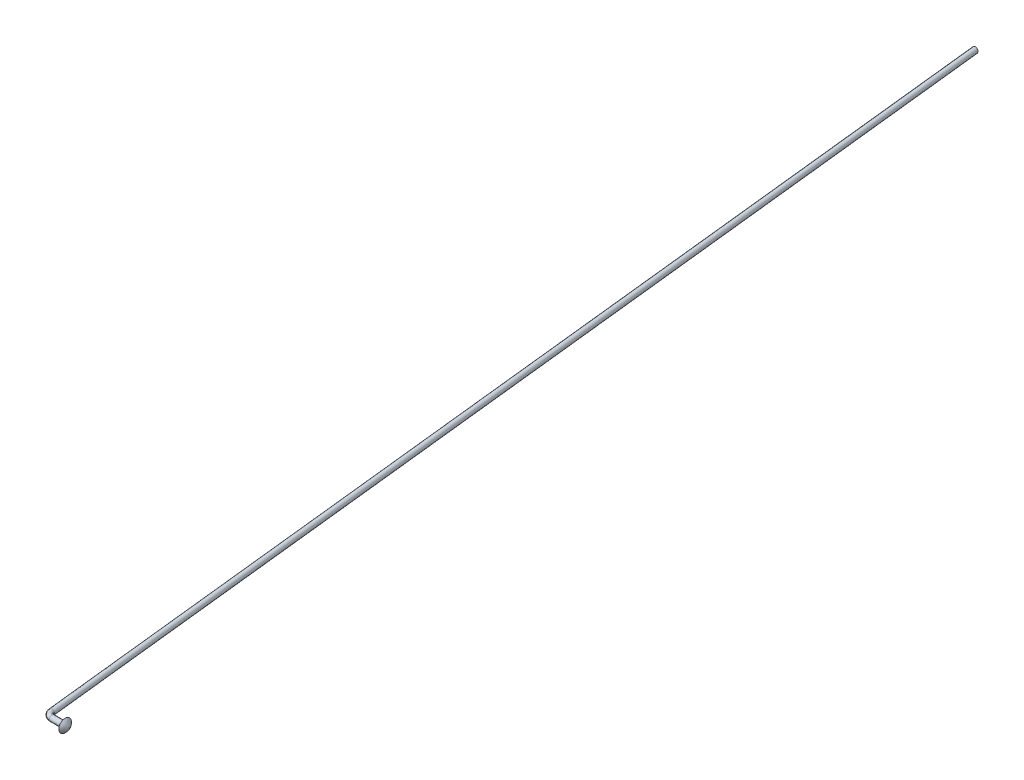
from build123d import *

# Parameters (mm, degrees)
SKETCH2_R = 0.75


with BuildPart() as part:
    # spitza: sweep along a path in spita
    with BuildLine(Plane(origin=(0, 0, 0), x_dir=(1, 0, 0), z_dir=(0, 1, 0))) as spitza_path:
        Line((-30.7, 0), (-0.73386076, -277.982639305))
        ThreePointArc((-0.73386076, -277.982639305), (-0.246645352, -278.942710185), (0.758258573, -279.329081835))
        Line((0.758258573, -279.329081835), (4.227817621, -279.329081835))
    # Sketch2 → spitza (sweep)
    with BuildSketch(Plane.XY):
        with Locations((-30.7, 0)):
            Circle(SKETCH2_R)
    sweep(path=spitza_path.line, transition=Transition.RIGHT)

    # Sketch3 → cap spita (revolve)
    with BuildSketch(Plane(origin=(0, 0, 0), x_dir=(1, 0, 0), z_dir=(0, 1, 0))):
        with BuildLine():
            Line((4.227817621, -279.329081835), (4.227817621, -277.629081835))
            ThreePointArc((4.227817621, -277.629081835), (4.871515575, -278.394553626), (5.227817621, -279.329081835))
            Line((5.227817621, -279.329081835), (4.227817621, -279.329081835))
        make_face()
    revolve(axis=Axis((4.227817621, 0, 279.329081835), (1, 0, 0)))


solid = part.part
